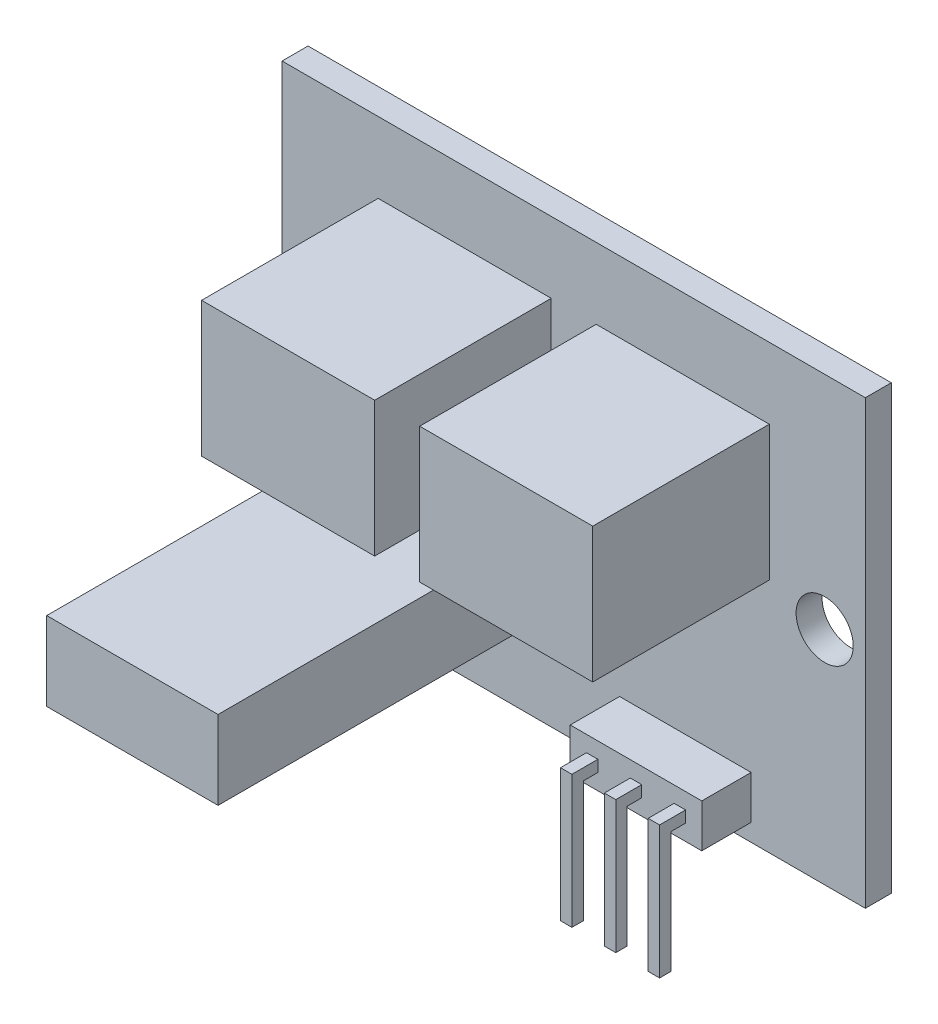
from build123d import *

# Parameters (mm, degrees)
SZKIC1_W                    = 33.7
SZKIC1_H                    = 25.55
SZKIC1_R                    = 1.65
DODANIE_WYCI_GNI_CIE1_DEPTH = 1.5
SZKIC2_W                    = 10
SZKIC2_H                    = 7.8
DODANIE_WYCI_GNI_CIE2_DEPTH = 10.2
SZKIC3_W                    = 9.9
SZKIC3_H                    = 4.55
DODANIE_WYCI_GNI_CIE3_DEPTH = 19
SZKIC4_W                    = 7.6
SZKIC4_H                    = 2.5
DODANIE_WYCI_GNI_CIE4_DEPTH = 2.85
SZKIC5_W                    = 0.66
SZKIC5_H                    = 0.66
DODANIE_WYCI_GNI_CIE5_DEPTH = 1.5
SZKIC6_W                    = 0.66
SZKIC6_H                    = 0.66
DODANIE_WYCI_GNI_CIE6_DEPTH = 7


with BuildPart() as part:
    # Szkic1 → Dodanie-wyci_gni_cie1 (new body)
    with BuildSketch(Plane.XY):
        with Locations((16.85, 12.775)):
            Rectangle(SZKIC1_W, SZKIC1_H)
        with Locations((31.35, 12.775)):
            Circle(SZKIC1_R, mode=Mode.SUBTRACT)
        with Locations((2.35, 12.775)):
            Circle(SZKIC1_R, mode=Mode.SUBTRACT)
    extrude(amount=DODANIE_WYCI_GNI_CIE1_DEPTH)

    # Szkic2 → Dodanie-wyci_gni_cie2 (add)
    with BuildSketch(Plane.XY.offset(1.5)):
        with Locations((10.55, 17.55)):
            Rectangle(SZKIC2_W, SZKIC2_H)
        with Locations((23.15, 17.55)):
            Rectangle(SZKIC2_W, SZKIC2_H)
    extrude(amount=DODANIE_WYCI_GNI_CIE2_DEPTH)

    # Szkic3 → Dodanie-wyci_gni_cie3 (add)
    with BuildSketch(Plane.XY.offset(1.5)):
        with Locations((10.35, 7.725)):
            Rectangle(SZKIC3_W, SZKIC3_H)
    extrude(amount=DODANIE_WYCI_GNI_CIE3_DEPTH)

    # Szkic4 → Dodanie-wyci_gni_cie4 (add)
    with BuildSketch(Plane.XY.offset(1.5)):
        with Locations((23.3, 2.25)):
            Rectangle(SZKIC4_W, SZKIC4_H)
    extrude(amount=DODANIE_WYCI_GNI_CIE4_DEPTH)

    # Szkic5 → Dodanie-wyci_gni_cie5 (add)
    with BuildSketch(Plane.XY.offset(4.35)):
        with Locations((20.766666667, 2.25)):
            Rectangle(SZKIC5_W, SZKIC5_H)
        with Locations((23.3, 2.25)):
            Rectangle(SZKIC5_W, SZKIC5_H)
        with Locations((25.833333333, 2.25)):
            Rectangle(SZKIC5_W, SZKIC5_H)
    extrude(amount=DODANIE_WYCI_GNI_CIE5_DEPTH)

    # Szkic6 → Dodanie-wyci_gni_cie6 (add)
    with BuildSketch(Plane.XZ.offset(-1.92)):
        with Locations((20.766666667, 5.52)):
            Rectangle(SZKIC6_W, SZKIC6_H)
        with Locations((23.3, 5.52)):
            Rectangle(SZKIC6_W, SZKIC6_H)
        with Locations((25.833333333, 5.52)):
            Rectangle(SZKIC6_W, SZKIC6_H)
    extrude(amount=DODANIE_WYCI_GNI_CIE6_DEPTH)


solid = part.part
